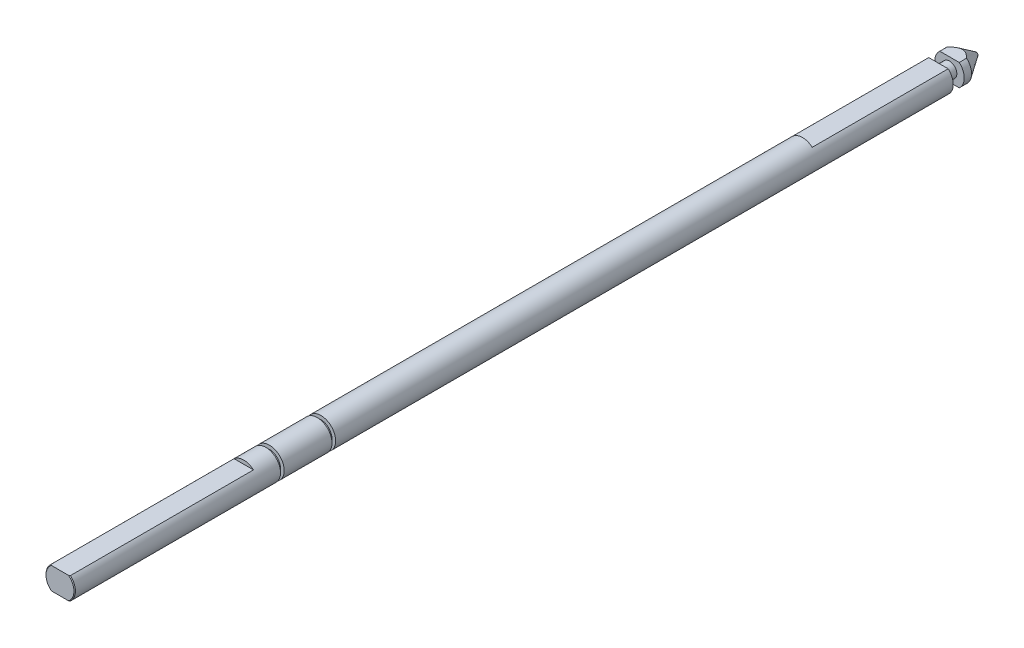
from build123d import *

# Parameters (mm, degrees)
ESQUISSE1_R             = 2
BASE_EXTRUSION_DEPTH    = 125
CHANFREIN1_SIZE         = 0.1
ESQUISSE2_W             = 25
ESQUISSE2_H             = 10
ENL_V_MAT_EXTRU_1_DEPTH = 5
ESQUISSE5_R             = 0.25
ENL_V_MAT_EXTRU_3_DEPTH = 0.5
ESQUISSE6_W             = 0.5
ESQUISSE6_H             = 1.862596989
ESQUISSE7_W             = 1.5
ESQUISSE7_H             = 10
ESQUISSE8_W             = 24
ESQUISSE8_H             = 10
ENL_V_MAT_EXTRU_4_DEPTH = 5


with BuildPart() as part:
    # Esquisse1 → Base-Extrusion (new body)
    with BuildSketch(Plane.XY):
        Circle(ESQUISSE1_R)
    extrude(amount=BASE_EXTRUSION_DEPTH)

    # Chanfrein1
    chanfrein1_edges = [part.edges().sort_by_distance(p)[0] for p in [
        (-2, 0, 125),
    ]]
    chamfer(chanfrein1_edges, length=CHANFREIN1_SIZE)

    # Esquisse2 → Enl_v. mat.-Extru.1 (cut, symmetric)
    with BuildSketch(Plane(origin=(0, 0, 0), x_dir=(0, 0, -1), z_dir=(1, 0, 0))):
        with Locations((-112.5, 6.5)):
            Rectangle(ESQUISSE2_W, ESQUISSE2_H)
        with Locations((-112.5, -6.5)):
            Rectangle(ESQUISSE2_W, ESQUISSE2_H)
    extrude(amount=ENL_V_MAT_EXTRU_1_DEPTH, both=True, mode=Mode.SUBTRACT)

    # Esquisse4 → Enl_vement de mati_re-R_volution1 (revolve, cut)
    with BuildSketch(Plane(origin=(0, 0, 0), x_dir=(0, 0, -1), z_dir=(1, 0, 0)), mode=Mode.PRIVATE) as enl_vement_de_mati_re_r_volution1_sk:
        Polygon((0, 0), (-3, 2), (-3, 5.021701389), (1.51716821, 5.021701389), (1.630015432, 0), align=None)
    revolve(enl_vement_de_mati_re_r_volution1_sk.sketch.rotate(Axis((0, 0, 0), (0, 0, 1)), 90), axis=Axis((0, 0, 0), (0, 0, 1)), mode=Mode.SUBTRACT)

    # Esquisse5 → Enl_v. mat.-Extru.3 (cut)
    with BuildSketch(Plane.XY):
        Circle(ESQUISSE5_R)
    extrude(amount=ENL_V_MAT_EXTRU_3_DEPTH, mode=Mode.SUBTRACT)

    # Esquisse6 → Enl_vement de mati_re-R_volution2 (revolve, cut)
    with BuildSketch(Plane(origin=(0, 0, 0), x_dir=(0, 0, -1), z_dir=(1, 0, 0)), mode=Mode.PRIVATE) as enl_vement_de_mati_re_r_volution2_sk:
        with Locations((-89.75, 2.431298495)):
            Rectangle(ESQUISSE6_W, ESQUISSE6_H)
        with Locations((-96.75, 2.431298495)):
            Rectangle(ESQUISSE6_W, ESQUISSE6_H)
    revolve(enl_vement_de_mati_re_r_volution2_sk.sketch.rotate(Axis((0, 0, 129.9), (0, 0, -1)), 90), axis=Axis((0, 0, 129.9), (0, 0, -1)), mode=Mode.SUBTRACT)

    # Esquisse7 → Enl_vement de mati_re-R_volution3 (revolve, cut)
    with BuildSketch(Plane(origin=(0, 0, 0), x_dir=(0, 0, -1), z_dir=(1, 0, 0)), mode=Mode.PRIVATE) as enl_vement_de_mati_re_r_volution3_sk:
        with Locations((-4.75, 6)):
            Rectangle(ESQUISSE7_W, ESQUISSE7_H)
    revolve(enl_vement_de_mati_re_r_volution3_sk.sketch.rotate(Axis((0, 0, 1.583836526), (0, 0, 1)), 90), axis=Axis((0, 0, 1.583836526), (0, 0, 1)), mode=Mode.SUBTRACT)

    # Esquisse8 → Enl_v. mat.-Extru.4 (cut, symmetric)
    with BuildSketch(Plane(origin=(0, 0, 0), x_dir=(0, 0, -1), z_dir=(1, 0, 0))):
        with Locations((-12, 6.5)):
            Rectangle(ESQUISSE8_W, ESQUISSE8_H)
        with Locations((-12, -6.5)):
            Rectangle(ESQUISSE8_W, ESQUISSE8_H)
    extrude(amount=ENL_V_MAT_EXTRU_4_DEPTH, both=True, mode=Mode.SUBTRACT)


solid = part.part
